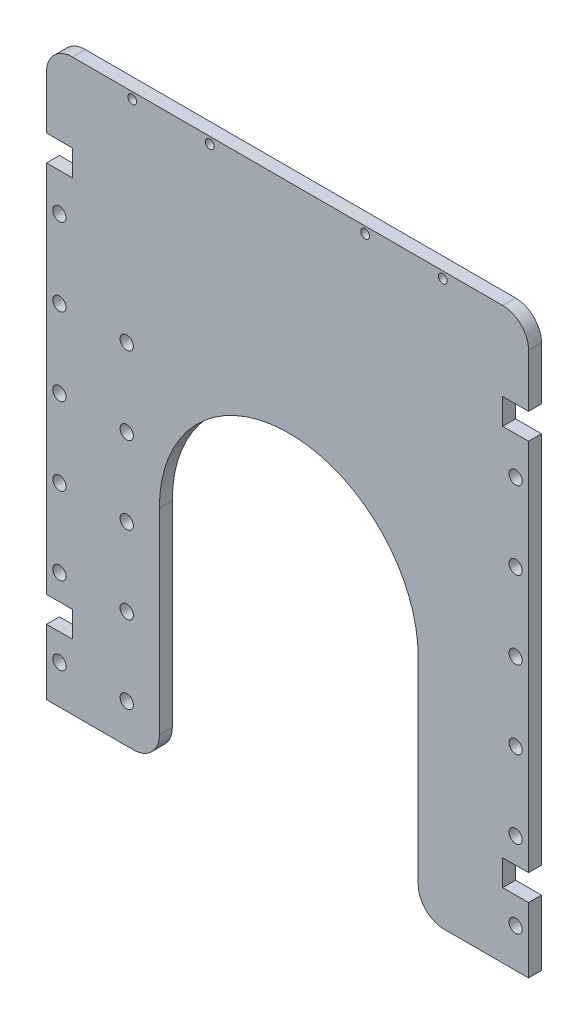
from build123d import *

# Parameters (mm, degrees)
BOSS_EXTRUDE1_DEPTH = 6.35
FILLET1_R           = 12.7
FILLET2_R           = 12.7
SKETCH2_R           = 3.25
CUT_EXTRUDE1_DEPTH  = 367.11054683
SKETCH3_R           = 3.25
CUT_EXTRUDE2_DEPTH  = 367.11054683
SKETCH4_W           = 12.7
SKETCH4_H           = 12.7
CUT_EXTRUDE3_DEPTH  = 12.7
SKETCH5_R           = 2.15
CUT_EXTRUDE4_DEPTH  = 367.11054683


with BuildPart() as part:
    # Sketch1 → Boss-Extrude1 (new body)
    with BuildSketch(Plane.XY):
        with BuildLine():
            Line((55.372, 0), (55.372, 109.22))
            ThreePointArc((55.372, 109.22), (73.970719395, 154.121280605), (118.872, 172.72))
            ThreePointArc((118.872, 172.72), (163.773280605, 154.121280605), (182.372, 109.22))
            Line((182.372, 109.22), (182.372, 0))
            Line((182.372, 0), (236.5, 0))
            Line((236.5, 0), (236.5, 279.4))
            Line((236.5, 279.4), (0, 279.4))
            Line((0, 279.4), (0, 0))
            Line((0, 0), (55.372, 0))
        make_face()
    extrude(amount=-BOSS_EXTRUDE1_DEPTH)

    # Fillet1
    fillet1_edges = [part.edges().sort_by_distance(p)[0] for p in [
        (0, 279.4, -3.175),
        (236.5, 279.4, -3.175),
    ]]
    fillet(fillet1_edges, radius=FILLET1_R)

    # Fillet2
    fillet2_edges = [part.edges().sort_by_distance(p)[0] for p in [
        (182.372, 0, -3.175),
        (55.372, 0, -3.175),
    ]]
    fillet(fillet2_edges, radius=FILLET2_R)

    # Sketch2 → Cut-Extrude1 (cut, through all)
    with BuildSketch(Plane.XY):
        with Locations((230.15, 209.55)):
            Circle(SKETCH2_R)
        with Locations((230.15, 171.45)):
            Circle(SKETCH2_R)
        with Locations((230.15, 133.35)):
            Circle(SKETCH2_R)
        with Locations((230.15, 95.25)):
            Circle(SKETCH2_R)
        with Locations((230.15, 57.15)):
            Circle(SKETCH2_R)
        with Locations((230.15, 19.05)):
            Circle(SKETCH2_R)
        with Locations(Location((6.35, 19.05, 0), (0, 0, 180))):
            Circle(SKETCH2_R)
        with Locations(Location((6.35, 57.15, 0), (0, 0, 180))):
            Circle(SKETCH2_R)
        with Locations(Location((6.35, 95.25, 0), (0, 0, 180))):
            Circle(SKETCH2_R)
        with Locations(Location((6.35, 133.35, 0), (0, 0, 180))):
            Circle(SKETCH2_R)
        with Locations(Location((6.35, 171.45, 0), (0, 0, 180))):
            Circle(SKETCH2_R)
        with Locations(Location((6.35, 209.55, 0), (0, 0, 180))):
            Circle(SKETCH2_R)
    extrude(amount=-CUT_EXTRUDE1_DEPTH, mode=Mode.SUBTRACT)

    # Sketch3 → Cut-Extrude2 (cut, through all)
    with BuildSketch(Plane.XY):
        with Locations((39.36000008, 19.05)):
            Circle(SKETCH3_R)
        with Locations((39.36000008, 57.15)):
            Circle(SKETCH3_R)
        with Locations((39.36000008, 95.25)):
            Circle(SKETCH3_R)
        with Locations((39.36000008, 133.35)):
            Circle(SKETCH3_R)
        with Locations((39.36000008, 171.45)):
            Circle(SKETCH3_R)
    extrude(amount=-CUT_EXTRUDE2_DEPTH, mode=Mode.SUBTRACT)

    # Sketch4 → Cut-Extrude3 (cut)
    with BuildSketch(Plane.XY):
        with Locations((6.35, 234.39)):
            Rectangle(SKETCH4_W, SKETCH4_H)
        with Locations((230.15, 234.39)):
            Rectangle(SKETCH4_W, SKETCH4_H)
        with Locations((230.15, 38.39)):
            Rectangle(SKETCH4_W, SKETCH4_H)
        with Locations((6.35, 38.39)):
            Rectangle(SKETCH4_W, SKETCH4_H)
    extrude(amount=-CUT_EXTRUDE3_DEPTH, mode=Mode.SUBTRACT)

    # Sketch5 → Cut-Extrude4 (cut, through all)
    with BuildSketch(Plane.XY):
        with Locations((194.45, 276.098)):
            Circle(SKETCH5_R)
        with Locations((156.35, 276.098)):
            Circle(SKETCH5_R)
        with Locations(Location((42.05, 276.098, 0), (0, 0, 180))):
            Circle(SKETCH5_R)
        with Locations(Location((80.15, 276.098, 0), (0, 0, 180))):
            Circle(SKETCH5_R)
    extrude(amount=-CUT_EXTRUDE4_DEPTH, mode=Mode.SUBTRACT)


solid = part.part
